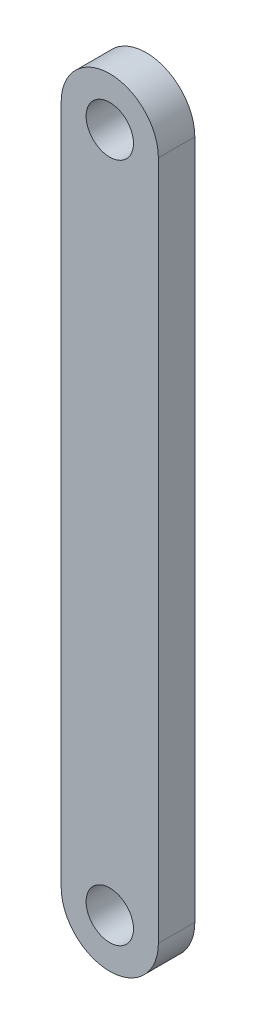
ISO-10303-21;
HEADER;
FILE_DESCRIPTION(('STEP AP214'),'2;1');
FILE_NAME('part.step','',(''),(''),'','','');
FILE_SCHEMA(('AUTOMOTIVE_DESIGN { 1 0 10303 214 1 1 1 1 }'));
ENDSEC;
DATA;
#1=APPLICATION_CONTEXT('core data for automotive mechanical design processes');
#2=APPLICATION_PROTOCOL_DEFINITION('international standard','automotive_design',2000,#1);
#3=PRODUCT_CONTEXT('',#1,'mechanical');
#4=PRODUCT('Part','Part','',(#3));
#5=PRODUCT_RELATED_PRODUCT_CATEGORY('part','',(#4));
#6=PRODUCT_DEFINITION_FORMATION('','',#4);
#7=PRODUCT_DEFINITION_CONTEXT('part definition',#1,'design');
#8=PRODUCT_DEFINITION('design','',#6,#7);
#9=PRODUCT_DEFINITION_SHAPE('','',#8);
#10=(LENGTH_UNIT() NAMED_UNIT(*) SI_UNIT(.MILLI.,.METRE.));
#11=(NAMED_UNIT(*) PLANE_ANGLE_UNIT() SI_UNIT($,.RADIAN.));
#12=(NAMED_UNIT(*) SI_UNIT($,.STERADIAN.) SOLID_ANGLE_UNIT());
#13=UNCERTAINTY_MEASURE_WITH_UNIT(LENGTH_MEASURE(1.E-05),#10,'distance_accuracy_value','');
#14=(GEOMETRIC_REPRESENTATION_CONTEXT(3) GLOBAL_UNCERTAINTY_ASSIGNED_CONTEXT((#13)) GLOBAL_UNIT_ASSIGNED_CONTEXT((#10,
#11,#12)) REPRESENTATION_CONTEXT('',''));
#15=CARTESIAN_POINT('',(0.,0.,0.));
#16=DIRECTION('',(0.,0.,1.));
#17=DIRECTION('',(1.,0.,0.));
#18=AXIS2_PLACEMENT_3D('',#15,#16,#17);
#19=CARTESIAN_POINT('',(0.,0.,3.));
#20=DIRECTION('',(0.,0.,-1.));
#21=DIRECTION('',(-1.,0.,0.));
#22=AXIS2_PLACEMENT_3D('',#19,#20,#21);
#23=CYLINDRICAL_SURFACE('',#22,4.);
#24=CARTESIAN_POINT('',(0.,0.,0.));
#25=DIRECTION('',(0.,0.,1.));
#26=DIRECTION('',(1.,0.,0.));
#27=AXIS2_PLACEMENT_3D('',#24,#25,#26);
#28=CIRCLE('',#27,4.);
#29=CARTESIAN_POINT('',(-4.,0.,0.));
#30=VERTEX_POINT('',#29);
#31=CARTESIAN_POINT('',(4.,0.,0.));
#32=VERTEX_POINT('',#31);
#33=EDGE_CURVE('E98',#30,#32,#28,.T.);
#34=ORIENTED_EDGE('',*,*,#33,.T.);
#35=DIRECTION('',(0.,0.,-1.));
#36=VECTOR('',#35,1.);
#37=CARTESIAN_POINT('',(4.,0.,3.));
#38=LINE('',#37,#36);
#39=CARTESIAN_POINT('',(4.,0.,3.));
#40=VERTEX_POINT('',#39);
#41=EDGE_CURVE('E11',#40,#32,#38,.T.);
#42=ORIENTED_EDGE('',*,*,#41,.F.);
#43=CARTESIAN_POINT('',(0.,0.,3.));
#44=DIRECTION('',(0.,0.,1.));
#45=DIRECTION('',(1.,0.,0.));
#46=AXIS2_PLACEMENT_3D('',#43,#44,#45);
#47=CIRCLE('',#46,4.);
#48=CARTESIAN_POINT('',(-4.,0.,3.));
#49=VERTEX_POINT('',#48);
#50=EDGE_CURVE('E86',#49,#40,#47,.T.);
#51=ORIENTED_EDGE('',*,*,#50,.F.);
#52=DIRECTION('',(0.,0.,-1.));
#53=VECTOR('',#52,1.);
#54=CARTESIAN_POINT('',(-4.,0.,3.));
#55=LINE('',#54,#53);
#56=EDGE_CURVE('E94',#49,#30,#55,.T.);
#57=ORIENTED_EDGE('',*,*,#56,.T.);
#58=EDGE_LOOP('',(#34,#42,#51,#57));
#59=FACE_BOUND('',#58,.T.);
#60=ADVANCED_FACE('F35',(#59),#23,.T.);
#61=CARTESIAN_POINT('',(4.,0.,3.));
#62=DIRECTION('',(-1.,0.,0.));
#63=DIRECTION('',(0.,0.,1.));
#64=AXIS2_PLACEMENT_3D('',#61,#62,#63);
#65=PLANE('',#64);
#66=DIRECTION('',(0.,1.,0.));
#67=VECTOR('',#66,1.);
#68=CARTESIAN_POINT('',(4.,0.,0.));
#69=LINE('',#68,#67);
#70=CARTESIAN_POINT('',(4.,56.,0.));
#71=VERTEX_POINT('',#70);
#72=EDGE_CURVE('E90',#32,#71,#69,.T.);
#73=ORIENTED_EDGE('',*,*,#72,.T.);
#74=DIRECTION('',(0.,0.,-1.));
#75=VECTOR('',#74,1.);
#76=CARTESIAN_POINT('',(4.,56.,3.));
#77=LINE('',#76,#75);
#78=CARTESIAN_POINT('',(4.,56.,3.));
#79=VERTEX_POINT('',#78);
#80=EDGE_CURVE('E43',#79,#71,#77,.T.);
#81=ORIENTED_EDGE('',*,*,#80,.F.);
#82=DIRECTION('',(0.,1.,0.));
#83=VECTOR('',#82,1.);
#84=CARTESIAN_POINT('',(4.,0.,3.));
#85=LINE('',#84,#83);
#86=EDGE_CURVE('E81',#40,#79,#85,.T.);
#87=ORIENTED_EDGE('',*,*,#86,.F.);
#88=ORIENTED_EDGE('',*,*,#41,.T.);
#89=EDGE_LOOP('',(#73,#81,#87,#88));
#90=FACE_BOUND('',#89,.T.);
#91=ADVANCED_FACE('F89',(#90),#65,.F.);
#92=CARTESIAN_POINT('',(0.,56.,3.));
#93=DIRECTION('',(0.,0.,-1.));
#94=DIRECTION('',(-1.,0.,0.));
#95=AXIS2_PLACEMENT_3D('',#92,#93,#94);
#96=CYLINDRICAL_SURFACE('',#95,4.);
#97=CARTESIAN_POINT('',(0.,56.,0.));
#98=DIRECTION('',(0.,0.,1.));
#99=DIRECTION('',(1.,0.,0.));
#100=AXIS2_PLACEMENT_3D('',#97,#98,#99);
#101=CIRCLE('',#100,4.);
#102=CARTESIAN_POINT('',(-4.,56.,0.));
#103=VERTEX_POINT('',#102);
#104=EDGE_CURVE('E68',#71,#103,#101,.T.);
#105=ORIENTED_EDGE('',*,*,#104,.T.);
#106=DIRECTION('',(0.,0.,-1.));
#107=VECTOR('',#106,1.);
#108=CARTESIAN_POINT('',(-4.,56.,3.));
#109=LINE('',#108,#107);
#110=CARTESIAN_POINT('',(-4.,56.,3.));
#111=VERTEX_POINT('',#110);
#112=EDGE_CURVE('E91',#111,#103,#109,.T.);
#113=ORIENTED_EDGE('',*,*,#112,.F.);
#114=CARTESIAN_POINT('',(0.,56.,3.));
#115=DIRECTION('',(0.,0.,1.));
#116=DIRECTION('',(1.,0.,0.));
#117=AXIS2_PLACEMENT_3D('',#114,#115,#116);
#118=CIRCLE('',#117,4.);
#119=EDGE_CURVE('E84',#79,#111,#118,.T.);
#120=ORIENTED_EDGE('',*,*,#119,.F.);
#121=ORIENTED_EDGE('',*,*,#80,.T.);
#122=EDGE_LOOP('',(#105,#113,#120,#121));
#123=FACE_BOUND('',#122,.T.);
#124=ADVANCED_FACE('F92',(#123),#96,.T.);
#125=CARTESIAN_POINT('',(-4.,0.,3.));
#126=DIRECTION('',(1.,0.,0.));
#127=DIRECTION('',(0.,0.,-1.));
#128=AXIS2_PLACEMENT_3D('',#125,#126,#127);
#129=PLANE('',#128);
#130=DIRECTION('',(0.,-1.,0.));
#131=VECTOR('',#130,1.);
#132=CARTESIAN_POINT('',(-4.,0.,0.));
#133=LINE('',#132,#131);
#134=EDGE_CURVE('E74',#103,#30,#133,.T.);
#135=ORIENTED_EDGE('',*,*,#134,.T.);
#136=ORIENTED_EDGE('',*,*,#56,.F.);
#137=DIRECTION('',(0.,-1.,0.));
#138=VECTOR('',#137,1.);
#139=CARTESIAN_POINT('',(-4.,0.,3.));
#140=LINE('',#139,#138);
#141=EDGE_CURVE('E51',#111,#49,#140,.T.);
#142=ORIENTED_EDGE('',*,*,#141,.F.);
#143=ORIENTED_EDGE('',*,*,#112,.T.);
#144=EDGE_LOOP('',(#135,#136,#142,#143));
#145=FACE_BOUND('',#144,.T.);
#146=ADVANCED_FACE('F106',(#145),#129,.F.);
#147=CARTESIAN_POINT('',(0.,0.,3.));
#148=DIRECTION('',(0.,0.,1.));
#149=DIRECTION('',(1.,0.,0.));
#150=AXIS2_PLACEMENT_3D('',#147,#148,#149);
#151=PLANE('',#150);
#152=CARTESIAN_POINT('',(0.,56.,3.));
#153=DIRECTION('',(0.,0.,1.));
#154=DIRECTION('',(1.,0.,0.));
#155=AXIS2_PLACEMENT_3D('',#152,#153,#154);
#156=CIRCLE('',#155,1.95);
#157=CARTESIAN_POINT('',(1.95,56.,3.));
#158=VERTEX_POINT('',#157);
#159=EDGE_CURVE('E120',#158,#158,#156,.T.);
#160=ORIENTED_EDGE('',*,*,#159,.F.);
#161=EDGE_LOOP('',(#160));
#162=FACE_BOUND('',#161,.T.);
#163=CARTESIAN_POINT('',(0.,0.,3.));
#164=DIRECTION('',(0.,0.,1.));
#165=DIRECTION('',(1.,0.,0.));
#166=AXIS2_PLACEMENT_3D('',#163,#164,#165);
#167=CIRCLE('',#166,1.95);
#168=CARTESIAN_POINT('',(1.95,0.,3.));
#169=VERTEX_POINT('',#168);
#170=EDGE_CURVE('E114',#169,#169,#167,.T.);
#171=ORIENTED_EDGE('',*,*,#170,.F.);
#172=EDGE_LOOP('',(#171));
#173=FACE_BOUND('',#172,.T.);
#174=ORIENTED_EDGE('',*,*,#50,.T.);
#175=ORIENTED_EDGE('',*,*,#86,.T.);
#176=ORIENTED_EDGE('',*,*,#119,.T.);
#177=ORIENTED_EDGE('',*,*,#141,.T.);
#178=EDGE_LOOP('',(#174,#175,#176,#177));
#179=FACE_BOUND('',#178,.T.);
#180=ADVANCED_FACE('F82',(#162,#173,#179),#151,.T.);
#181=CARTESIAN_POINT('',(0.,0.,0.));
#182=DIRECTION('',(0.,0.,1.));
#183=DIRECTION('',(1.,0.,0.));
#184=AXIS2_PLACEMENT_3D('',#181,#182,#183);
#185=PLANE('',#184);
#186=CARTESIAN_POINT('',(0.,56.,0.));
#187=DIRECTION('',(0.,0.,1.));
#188=DIRECTION('',(1.,0.,0.));
#189=AXIS2_PLACEMENT_3D('',#186,#187,#188);
#190=CIRCLE('',#189,1.95);
#191=CARTESIAN_POINT('',(1.95,56.,0.));
#192=VERTEX_POINT('',#191);
#193=EDGE_CURVE('E117',#192,#192,#190,.T.);
#194=ORIENTED_EDGE('',*,*,#193,.T.);
#195=EDGE_LOOP('',(#194));
#196=FACE_BOUND('',#195,.T.);
#197=CARTESIAN_POINT('',(0.,0.,0.));
#198=DIRECTION('',(0.,0.,1.));
#199=DIRECTION('',(1.,0.,0.));
#200=AXIS2_PLACEMENT_3D('',#197,#198,#199);
#201=CIRCLE('',#200,1.95);
#202=CARTESIAN_POINT('',(1.95,0.,0.));
#203=VERTEX_POINT('',#202);
#204=EDGE_CURVE('E101',#203,#203,#201,.T.);
#205=ORIENTED_EDGE('',*,*,#204,.T.);
#206=EDGE_LOOP('',(#205));
#207=FACE_BOUND('',#206,.T.);
#208=ORIENTED_EDGE('',*,*,#33,.F.);
#209=ORIENTED_EDGE('',*,*,#134,.F.);
#210=ORIENTED_EDGE('',*,*,#104,.F.);
#211=ORIENTED_EDGE('',*,*,#72,.F.);
#212=EDGE_LOOP('',(#208,#209,#210,#211));
#213=FACE_BOUND('',#212,.T.);
#214=ADVANCED_FACE('F109',(#196,#207,#213),#185,.F.);
#215=CARTESIAN_POINT('',(0.,0.,3.));
#216=DIRECTION('',(0.,0.,1.));
#217=DIRECTION('',(1.,0.,0.));
#218=AXIS2_PLACEMENT_3D('',#215,#216,#217);
#219=CYLINDRICAL_SURFACE('',#218,1.95);
#220=ORIENTED_EDGE('',*,*,#204,.F.);
#221=EDGE_LOOP('',(#220));
#222=FACE_BOUND('',#221,.T.);
#223=ORIENTED_EDGE('',*,*,#170,.T.);
#224=EDGE_LOOP('',(#223));
#225=FACE_BOUND('',#224,.T.);
#226=ADVANCED_FACE('F131',(#222,#225),#219,.F.);
#227=CARTESIAN_POINT('',(0.,56.,3.));
#228=DIRECTION('',(0.,0.,1.));
#229=DIRECTION('',(1.,0.,0.));
#230=AXIS2_PLACEMENT_3D('',#227,#228,#229);
#231=CYLINDRICAL_SURFACE('',#230,1.95);
#232=ORIENTED_EDGE('',*,*,#193,.F.);
#233=EDGE_LOOP('',(#232));
#234=FACE_BOUND('',#233,.T.);
#235=ORIENTED_EDGE('',*,*,#159,.T.);
#236=EDGE_LOOP('',(#235));
#237=FACE_BOUND('',#236,.T.);
#238=ADVANCED_FACE('F124',(#234,#237),#231,.F.);
#239=CLOSED_SHELL('',(#60,#91,#124,#146,#180,#214,#226,#238));
#240=MANIFOLD_SOLID_BREP('B2',#239);
#241=ADVANCED_BREP_SHAPE_REPRESENTATION('',(#18,#240),#14);
#242=SHAPE_DEFINITION_REPRESENTATION(#9,#241);
ENDSEC;
END-ISO-10303-21;
